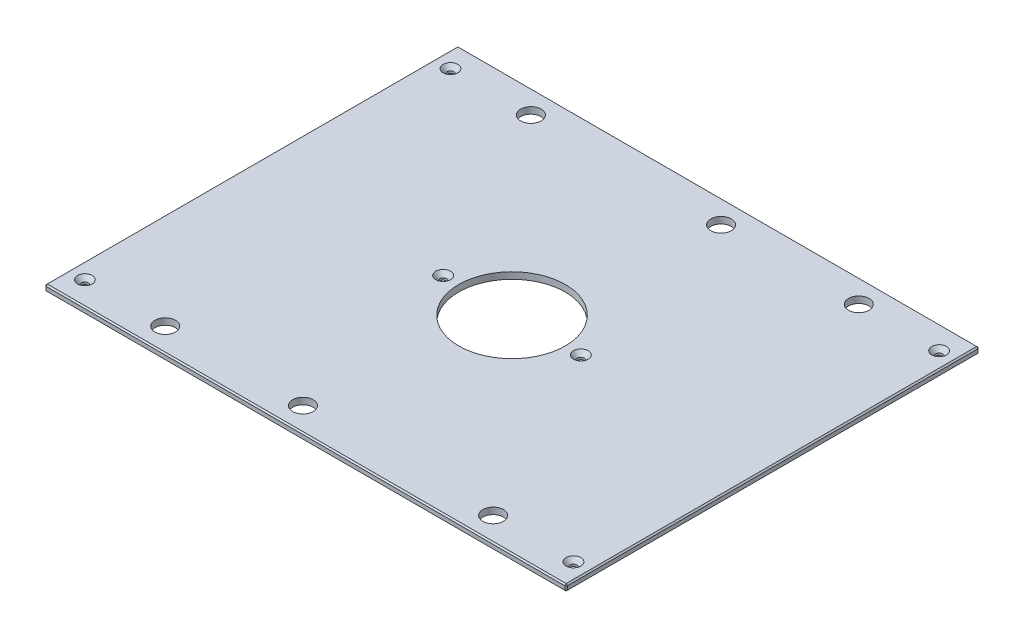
ISO-10303-21;
HEADER;
FILE_DESCRIPTION(('STEP AP214'),'2;1');
FILE_NAME('part.step','',(''),(''),'','','');
FILE_SCHEMA(('AUTOMOTIVE_DESIGN { 1 0 10303 214 1 1 1 1 }'));
ENDSEC;
DATA;
#1=APPLICATION_CONTEXT('core data for automotive mechanical design processes');
#2=APPLICATION_PROTOCOL_DEFINITION('international standard','automotive_design',2000,#1);
#3=PRODUCT_CONTEXT('',#1,'mechanical');
#4=PRODUCT('Part','Part','',(#3));
#5=PRODUCT_RELATED_PRODUCT_CATEGORY('part','',(#4));
#6=PRODUCT_DEFINITION_FORMATION('','',#4);
#7=PRODUCT_DEFINITION_CONTEXT('part definition',#1,'design');
#8=PRODUCT_DEFINITION('design','',#6,#7);
#9=PRODUCT_DEFINITION_SHAPE('','',#8);
#10=(LENGTH_UNIT() NAMED_UNIT(*) SI_UNIT(.MILLI.,.METRE.));
#11=(NAMED_UNIT(*) PLANE_ANGLE_UNIT() SI_UNIT($,.RADIAN.));
#12=(NAMED_UNIT(*) SI_UNIT($,.STERADIAN.) SOLID_ANGLE_UNIT());
#13=UNCERTAINTY_MEASURE_WITH_UNIT(LENGTH_MEASURE(1.E-05),#10,'distance_accuracy_value','');
#14=(GEOMETRIC_REPRESENTATION_CONTEXT(3) GLOBAL_UNCERTAINTY_ASSIGNED_CONTEXT((#13)) GLOBAL_UNIT_ASSIGNED_CONTEXT((#10,
#11,#12)) REPRESENTATION_CONTEXT('',''));
#15=CARTESIAN_POINT('',(0.,0.,0.));
#16=DIRECTION('',(0.,0.,1.));
#17=DIRECTION('',(1.,0.,0.));
#18=AXIS2_PLACEMENT_3D('',#15,#16,#17);
#19=CARTESIAN_POINT('',(-252.4125,6.35,-200.025));
#20=DIRECTION('',(1.,0.,0.));
#21=DIRECTION('',(0.,0.,-1.));
#22=AXIS2_PLACEMENT_3D('',#19,#20,#21);
#23=PLANE('',#22);
#24=DIRECTION('',(0.,0.,-1.));
#25=VECTOR('',#24,1.);
#26=CARTESIAN_POINT('',(-252.4125,5.08000000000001,-200.025));
#27=LINE('',#26,#25);
#28=CARTESIAN_POINT('',(-252.4125,5.08000000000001,198.755));
#29=VERTEX_POINT('',#28);
#30=CARTESIAN_POINT('',(-252.4125,5.08000000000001,-198.755));
#31=VERTEX_POINT('',#30);
#32=EDGE_CURVE('E135',#29,#31,#27,.T.);
#33=ORIENTED_EDGE('',*,*,#32,.T.);
#34=DIRECTION('',(0.,-1.,0.));
#35=VECTOR('',#34,1.);
#36=CARTESIAN_POINT('',(-252.4125,6.35,-198.755));
#37=LINE('',#36,#35);
#38=CARTESIAN_POINT('',(-252.4125,1.26999999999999,-198.755));
#39=VERTEX_POINT('',#38);
#40=EDGE_CURVE('E131',#31,#39,#37,.T.);
#41=ORIENTED_EDGE('',*,*,#40,.T.);
#42=DIRECTION('',(0.,0.,1.));
#43=VECTOR('',#42,1.);
#44=CARTESIAN_POINT('',(-252.4125,1.26999999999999,-200.025));
#45=LINE('',#44,#43);
#46=CARTESIAN_POINT('',(-252.4125,1.26999999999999,198.755));
#47=VERTEX_POINT('',#46);
#48=EDGE_CURVE('E126',#39,#47,#45,.T.);
#49=ORIENTED_EDGE('',*,*,#48,.T.);
#50=DIRECTION('',(0.,1.,0.));
#51=VECTOR('',#50,1.);
#52=CARTESIAN_POINT('',(-252.4125,6.35,198.755));
#53=LINE('',#52,#51);
#54=EDGE_CURVE('E128',#47,#29,#53,.T.);
#55=ORIENTED_EDGE('',*,*,#54,.T.);
#56=EDGE_LOOP('',(#33,#41,#49,#55));
#57=FACE_BOUND('',#56,.T.);
#58=ADVANCED_FACE('F35',(#57),#23,.F.);
#59=CARTESIAN_POINT('',(-252.4125,6.35,200.025));
#60=DIRECTION('',(0.,0.,-1.));
#61=DIRECTION('',(-1.,0.,0.));
#62=AXIS2_PLACEMENT_3D('',#59,#60,#61);
#63=PLANE('',#62);
#64=DIRECTION('',(1.,0.,0.));
#65=VECTOR('',#64,1.);
#66=CARTESIAN_POINT('',(-252.4125,1.26999999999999,200.025));
#67=LINE('',#66,#65);
#68=CARTESIAN_POINT('',(-251.1425,1.26999999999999,200.025));
#69=VERTEX_POINT('',#68);
#70=CARTESIAN_POINT('',(251.1425,1.26999999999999,200.025));
#71=VERTEX_POINT('',#70);
#72=EDGE_CURVE('E58',#69,#71,#67,.T.);
#73=ORIENTED_EDGE('',*,*,#72,.T.);
#74=DIRECTION('',(0.,1.,0.));
#75=VECTOR('',#74,1.);
#76=CARTESIAN_POINT('',(251.1425,6.35,200.025));
#77=LINE('',#76,#75);
#78=CARTESIAN_POINT('',(251.1425,5.08000000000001,200.025));
#79=VERTEX_POINT('',#78);
#80=EDGE_CURVE('E11',#71,#79,#77,.T.);
#81=ORIENTED_EDGE('',*,*,#80,.T.);
#82=DIRECTION('',(-1.,0.,0.));
#83=VECTOR('',#82,1.);
#84=CARTESIAN_POINT('',(-252.4125,5.08000000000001,200.025));
#85=LINE('',#84,#83);
#86=CARTESIAN_POINT('',(-251.1425,5.08000000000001,200.025));
#87=VERTEX_POINT('',#86);
#88=EDGE_CURVE('E44',#79,#87,#85,.T.);
#89=ORIENTED_EDGE('',*,*,#88,.T.);
#90=DIRECTION('',(0.,-1.,0.));
#91=VECTOR('',#90,1.);
#92=CARTESIAN_POINT('',(-251.1425,6.35,200.025));
#93=LINE('',#92,#91);
#94=EDGE_CURVE('E291',#87,#69,#93,.T.);
#95=ORIENTED_EDGE('',*,*,#94,.T.);
#96=EDGE_LOOP('',(#73,#81,#89,#95));
#97=FACE_BOUND('',#96,.T.);
#98=ADVANCED_FACE('F360',(#97),#63,.F.);
#99=CARTESIAN_POINT('',(252.4125,6.35,-200.025));
#100=DIRECTION('',(-1.,0.,0.));
#101=DIRECTION('',(0.,0.,1.));
#102=AXIS2_PLACEMENT_3D('',#99,#100,#101);
#103=PLANE('',#102);
#104=DIRECTION('',(0.,0.,-1.));
#105=VECTOR('',#104,1.);
#106=CARTESIAN_POINT('',(252.4125,1.26999999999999,-200.025));
#107=LINE('',#106,#105);
#108=CARTESIAN_POINT('',(252.4125,1.26999999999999,198.755));
#109=VERTEX_POINT('',#108);
#110=CARTESIAN_POINT('',(252.4125,1.26999999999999,-198.755));
#111=VERTEX_POINT('',#110);
#112=EDGE_CURVE('E286',#109,#111,#107,.T.);
#113=ORIENTED_EDGE('',*,*,#112,.T.);
#114=DIRECTION('',(0.,1.,0.));
#115=VECTOR('',#114,1.);
#116=CARTESIAN_POINT('',(252.4125,6.35,-198.755));
#117=LINE('',#116,#115);
#118=CARTESIAN_POINT('',(252.4125,5.08000000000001,-198.755));
#119=VERTEX_POINT('',#118);
#120=EDGE_CURVE('E288',#111,#119,#117,.T.);
#121=ORIENTED_EDGE('',*,*,#120,.T.);
#122=DIRECTION('',(0.,0.,1.));
#123=VECTOR('',#122,1.);
#124=CARTESIAN_POINT('',(252.4125,5.08000000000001,200.025));
#125=LINE('',#124,#123);
#126=CARTESIAN_POINT('',(252.4125,5.08000000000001,198.755));
#127=VERTEX_POINT('',#126);
#128=EDGE_CURVE('E284',#119,#127,#125,.T.);
#129=ORIENTED_EDGE('',*,*,#128,.T.);
#130=DIRECTION('',(0.,-1.,0.));
#131=VECTOR('',#130,1.);
#132=CARTESIAN_POINT('',(252.4125,6.35,198.755));
#133=LINE('',#132,#131);
#134=EDGE_CURVE('E282',#127,#109,#133,.T.);
#135=ORIENTED_EDGE('',*,*,#134,.T.);
#136=EDGE_LOOP('',(#113,#121,#129,#135));
#137=FACE_BOUND('',#136,.T.);
#138=ADVANCED_FACE('F347',(#137),#103,.F.);
#139=CARTESIAN_POINT('',(-252.4125,6.35,-200.025));
#140=DIRECTION('',(0.,0.,1.));
#141=DIRECTION('',(1.,0.,0.));
#142=AXIS2_PLACEMENT_3D('',#139,#140,#141);
#143=PLANE('',#142);
#144=DIRECTION('',(-1.,0.,0.));
#145=VECTOR('',#144,1.);
#146=CARTESIAN_POINT('',(-252.4125,1.26999999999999,-200.025));
#147=LINE('',#146,#145);
#148=CARTESIAN_POINT('',(251.1425,1.26999999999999,-200.025));
#149=VERTEX_POINT('',#148);
#150=CARTESIAN_POINT('',(-251.1425,1.26999999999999,-200.025));
#151=VERTEX_POINT('',#150);
#152=EDGE_CURVE('E258',#149,#151,#147,.T.);
#153=ORIENTED_EDGE('',*,*,#152,.T.);
#154=DIRECTION('',(0.,1.,0.));
#155=VECTOR('',#154,1.);
#156=CARTESIAN_POINT('',(-251.1425,6.35,-200.025));
#157=LINE('',#156,#155);
#158=CARTESIAN_POINT('',(-251.1425,5.08000000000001,-200.025));
#159=VERTEX_POINT('',#158);
#160=EDGE_CURVE('E262',#151,#159,#157,.T.);
#161=ORIENTED_EDGE('',*,*,#160,.T.);
#162=DIRECTION('',(1.,0.,0.));
#163=VECTOR('',#162,1.);
#164=CARTESIAN_POINT('',(252.4125,5.08000000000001,-200.025));
#165=LINE('',#164,#163);
#166=CARTESIAN_POINT('',(251.1425,5.08000000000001,-200.025));
#167=VERTEX_POINT('',#166);
#168=EDGE_CURVE('E260',#159,#167,#165,.T.);
#169=ORIENTED_EDGE('',*,*,#168,.T.);
#170=DIRECTION('',(0.,-1.,0.));
#171=VECTOR('',#170,1.);
#172=CARTESIAN_POINT('',(251.1425,6.35,-200.025));
#173=LINE('',#172,#171);
#174=EDGE_CURVE('E256',#167,#149,#173,.T.);
#175=ORIENTED_EDGE('',*,*,#174,.T.);
#176=EDGE_LOOP('',(#153,#161,#169,#175));
#177=FACE_BOUND('',#176,.T.);
#178=ADVANCED_FACE('F321',(#177),#143,.F.);
#179=CARTESIAN_POINT('',(0.,6.35,0.));
#180=DIRECTION('',(0.,1.,0.));
#181=DIRECTION('',(0.,0.,1.));
#182=AXIS2_PLACEMENT_3D('',#179,#180,#181);
#183=PLANE('',#182);
#184=CARTESIAN_POINT('',(236.5375,6.35,-177.00498));
#185=DIRECTION('',(0.,1.,0.));
#186=DIRECTION('',(0.,0.,1.));
#187=AXIS2_PLACEMENT_3D('',#184,#185,#186);
#188=CIRCLE('',#187,7.13739999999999);
#189=CARTESIAN_POINT('',(236.5375,6.35,-169.86758));
#190=VERTEX_POINT('',#189);
#191=EDGE_CURVE('E784',#190,#190,#188,.T.);
#192=ORIENTED_EDGE('',*,*,#191,.F.);
#193=EDGE_LOOP('',(#192));
#194=FACE_BOUND('',#193,.T.);
#195=CARTESIAN_POINT('',(236.5375,6.35,177.00498));
#196=DIRECTION('',(0.,1.,0.));
#197=DIRECTION('',(0.,0.,1.));
#198=AXIS2_PLACEMENT_3D('',#195,#196,#197);
#199=CIRCLE('',#198,7.13739999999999);
#200=CARTESIAN_POINT('',(236.5375,6.35,184.14238));
#201=VERTEX_POINT('',#200);
#202=EDGE_CURVE('E788',#201,#201,#199,.T.);
#203=ORIENTED_EDGE('',*,*,#202,.F.);
#204=EDGE_LOOP('',(#203));
#205=FACE_BOUND('',#204,.T.);
#206=CARTESIAN_POINT('',(-236.5375,6.35,177.00498));
#207=DIRECTION('',(0.,1.,0.));
#208=DIRECTION('',(0.,0.,1.));
#209=AXIS2_PLACEMENT_3D('',#206,#207,#208);
#210=CIRCLE('',#209,7.13739999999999);
#211=CARTESIAN_POINT('',(-236.5375,6.35,184.14238));
#212=VERTEX_POINT('',#211);
#213=EDGE_CURVE('E792',#212,#212,#210,.T.);
#214=ORIENTED_EDGE('',*,*,#213,.F.);
#215=EDGE_LOOP('',(#214));
#216=FACE_BOUND('',#215,.T.);
#217=CARTESIAN_POINT('',(-66.675,6.35,0.));
#218=DIRECTION('',(0.,1.,0.));
#219=DIRECTION('',(0.,0.,1.));
#220=AXIS2_PLACEMENT_3D('',#217,#218,#219);
#221=CIRCLE('',#220,7.1374);
#222=CARTESIAN_POINT('',(-66.675,6.35,7.1374));
#223=VERTEX_POINT('',#222);
#224=EDGE_CURVE('E796',#223,#223,#221,.T.);
#225=ORIENTED_EDGE('',*,*,#224,.F.);
#226=EDGE_LOOP('',(#225));
#227=FACE_BOUND('',#226,.T.);
#228=CARTESIAN_POINT('',(66.675,6.35,0.));
#229=DIRECTION('',(0.,1.,0.));
#230=DIRECTION('',(0.,0.,1.));
#231=AXIS2_PLACEMENT_3D('',#228,#229,#230);
#232=CIRCLE('',#231,7.1374);
#233=CARTESIAN_POINT('',(66.675,6.35,7.1374));
#234=VERTEX_POINT('',#233);
#235=EDGE_CURVE('E800',#234,#234,#232,.T.);
#236=ORIENTED_EDGE('',*,*,#235,.F.);
#237=EDGE_LOOP('',(#236));
#238=FACE_BOUND('',#237,.T.);
#239=CARTESIAN_POINT('',(-236.5375,6.35,-177.00498));
#240=DIRECTION('',(0.,1.,0.));
#241=DIRECTION('',(0.,0.,1.));
#242=AXIS2_PLACEMENT_3D('',#239,#240,#241);
#243=CIRCLE('',#242,7.13739999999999);
#244=CARTESIAN_POINT('',(-236.5375,6.35,-169.86758));
#245=VERTEX_POINT('',#244);
#246=EDGE_CURVE('E803',#245,#245,#243,.T.);
#247=ORIENTED_EDGE('',*,*,#246,.F.);
#248=EDGE_LOOP('',(#247));
#249=FACE_BOUND('',#248,.T.);
#250=DIRECTION('',(0.,0.,-1.));
#251=VECTOR('',#250,1.);
#252=CARTESIAN_POINT('',(251.1425,6.35,-200.025));
#253=LINE('',#252,#251);
#254=CARTESIAN_POINT('',(251.1425,6.35,198.755));
#255=VERTEX_POINT('',#254);
#256=CARTESIAN_POINT('',(251.1425,6.35,-198.755));
#257=VERTEX_POINT('',#256);
#258=EDGE_CURVE('E269',#255,#257,#253,.T.);
#259=ORIENTED_EDGE('',*,*,#258,.T.);
#260=DIRECTION('',(-1.,0.,0.));
#261=VECTOR('',#260,1.);
#262=CARTESIAN_POINT('',(-252.4125,6.35,-198.755));
#263=LINE('',#262,#261);
#264=CARTESIAN_POINT('',(-251.1425,6.35,-198.755));
#265=VERTEX_POINT('',#264);
#266=EDGE_CURVE('E271',#257,#265,#263,.T.);
#267=ORIENTED_EDGE('',*,*,#266,.T.);
#268=DIRECTION('',(0.,0.,1.));
#269=VECTOR('',#268,1.);
#270=CARTESIAN_POINT('',(-251.1425,6.35,200.025));
#271=LINE('',#270,#269);
#272=CARTESIAN_POINT('',(-251.1425,6.35,198.755));
#273=VERTEX_POINT('',#272);
#274=EDGE_CURVE('E267',#265,#273,#271,.T.);
#275=ORIENTED_EDGE('',*,*,#274,.T.);
#276=DIRECTION('',(1.,0.,0.));
#277=VECTOR('',#276,1.);
#278=CARTESIAN_POINT('',(252.4125,6.35,198.755));
#279=LINE('',#278,#277);
#280=EDGE_CURVE('E265',#273,#255,#279,.T.);
#281=ORIENTED_EDGE('',*,*,#280,.T.);
#282=EDGE_LOOP('',(#259,#267,#275,#281));
#283=FACE_BOUND('',#282,.T.);
#284=CARTESIAN_POINT('',(158.75,6.35,-177.00498));
#285=DIRECTION('',(0.,1.,0.));
#286=DIRECTION('',(0.,0.,1.));
#287=AXIS2_PLACEMENT_3D('',#284,#285,#286);
#288=CIRCLE('',#287,9.921875);
#289=CARTESIAN_POINT('',(158.75,6.35,-167.083105));
#290=VERTEX_POINT('',#289);
#291=EDGE_CURVE('E204',#290,#290,#288,.T.);
#292=ORIENTED_EDGE('',*,*,#291,.F.);
#293=EDGE_LOOP('',(#292));
#294=FACE_BOUND('',#293,.T.);
#295=CARTESIAN_POINT('',(-158.75,6.35,-177.00498));
#296=DIRECTION('',(0.,1.,0.));
#297=DIRECTION('',(0.,0.,1.));
#298=AXIS2_PLACEMENT_3D('',#295,#296,#297);
#299=CIRCLE('',#298,9.921875);
#300=CARTESIAN_POINT('',(-158.75,6.35,-167.083105));
#301=VERTEX_POINT('',#300);
#302=EDGE_CURVE('E214',#301,#301,#299,.T.);
#303=ORIENTED_EDGE('',*,*,#302,.F.);
#304=EDGE_LOOP('',(#303));
#305=FACE_BOUND('',#304,.T.);
#306=CARTESIAN_POINT('',(158.75,6.35,177.00498));
#307=DIRECTION('',(0.,1.,0.));
#308=DIRECTION('',(0.,0.,1.));
#309=AXIS2_PLACEMENT_3D('',#306,#307,#308);
#310=CIRCLE('',#309,9.921875);
#311=CARTESIAN_POINT('',(158.75,6.35,186.926855));
#312=VERTEX_POINT('',#311);
#313=EDGE_CURVE('E225',#312,#312,#310,.T.);
#314=ORIENTED_EDGE('',*,*,#313,.F.);
#315=EDGE_LOOP('',(#314));
#316=FACE_BOUND('',#315,.T.);
#317=CARTESIAN_POINT('',(-158.75,6.35,177.00498));
#318=DIRECTION('',(0.,1.,0.));
#319=DIRECTION('',(0.,0.,1.));
#320=AXIS2_PLACEMENT_3D('',#317,#318,#319);
#321=CIRCLE('',#320,9.921875);
#322=CARTESIAN_POINT('',(-158.75,6.35,186.926855));
#323=VERTEX_POINT('',#322);
#324=EDGE_CURVE('E231',#323,#323,#321,.T.);
#325=ORIENTED_EDGE('',*,*,#324,.F.);
#326=EDGE_LOOP('',(#325));
#327=FACE_BOUND('',#326,.T.);
#328=CARTESIAN_POINT('',(25.4,6.35,-177.00498));
#329=DIRECTION('',(0.,1.,0.));
#330=DIRECTION('',(0.,0.,1.));
#331=AXIS2_PLACEMENT_3D('',#328,#329,#330);
#332=CIRCLE('',#331,9.921875);
#333=CARTESIAN_POINT('',(25.4,6.35,-167.083105));
#334=VERTEX_POINT('',#333);
#335=EDGE_CURVE('E237',#334,#334,#332,.T.);
#336=ORIENTED_EDGE('',*,*,#335,.F.);
#337=EDGE_LOOP('',(#336));
#338=FACE_BOUND('',#337,.T.);
#339=CARTESIAN_POINT('',(-25.4,6.35,177.00498));
#340=DIRECTION('',(0.,1.,0.));
#341=DIRECTION('',(0.,0.,1.));
#342=AXIS2_PLACEMENT_3D('',#339,#340,#341);
#343=CIRCLE('',#342,9.921875);
#344=CARTESIAN_POINT('',(-25.4,6.35,186.926855));
#345=VERTEX_POINT('',#344);
#346=EDGE_CURVE('E243',#345,#345,#343,.T.);
#347=ORIENTED_EDGE('',*,*,#346,.F.);
#348=EDGE_LOOP('',(#347));
#349=FACE_BOUND('',#348,.T.);
#350=CARTESIAN_POINT('',(0.,6.35,0.));
#351=DIRECTION('',(0.,1.,0.));
#352=DIRECTION('',(0.,0.,1.));
#353=AXIS2_PLACEMENT_3D('',#350,#351,#352);
#354=CIRCLE('',#353,51.562);
#355=CARTESIAN_POINT('',(0.,6.35,51.562));
#356=VERTEX_POINT('',#355);
#357=EDGE_CURVE('E249',#356,#356,#354,.T.);
#358=ORIENTED_EDGE('',*,*,#357,.F.);
#359=EDGE_LOOP('',(#358));
#360=FACE_BOUND('',#359,.T.);
#361=ADVANCED_FACE('F369',(#194,#205,#216,#227,#238,#249,#283,#294,#305,#316,#327,#338,#349,
#360),#183,.T.);
#362=CARTESIAN_POINT('',(0.,0.,0.));
#363=DIRECTION('',(0.,1.,0.));
#364=DIRECTION('',(0.,0.,1.));
#365=AXIS2_PLACEMENT_3D('',#362,#363,#364);
#366=PLANE('',#365);
#367=CARTESIAN_POINT('',(236.5375,0.,-177.00498));
#368=DIRECTION('',(0.,1.,0.));
#369=DIRECTION('',(0.,0.,1.));
#370=AXIS2_PLACEMENT_3D('',#367,#368,#369);
#371=CIRCLE('',#370,3.3782);
#372=CARTESIAN_POINT('',(236.5375,0.,-173.62678));
#373=VERTEX_POINT('',#372);
#374=EDGE_CURVE('E837',#373,#373,#371,.T.);
#375=ORIENTED_EDGE('',*,*,#374,.T.);
#376=EDGE_LOOP('',(#375));
#377=FACE_BOUND('',#376,.T.);
#378=CARTESIAN_POINT('',(236.5375,0.,177.00498));
#379=DIRECTION('',(0.,1.,0.));
#380=DIRECTION('',(0.,0.,1.));
#381=AXIS2_PLACEMENT_3D('',#378,#379,#380);
#382=CIRCLE('',#381,3.3782);
#383=CARTESIAN_POINT('',(236.5375,0.,180.38318));
#384=VERTEX_POINT('',#383);
#385=EDGE_CURVE('E830',#384,#384,#382,.T.);
#386=ORIENTED_EDGE('',*,*,#385,.T.);
#387=EDGE_LOOP('',(#386));
#388=FACE_BOUND('',#387,.T.);
#389=CARTESIAN_POINT('',(-236.5375,0.,177.00498));
#390=DIRECTION('',(0.,1.,0.));
#391=DIRECTION('',(0.,0.,1.));
#392=AXIS2_PLACEMENT_3D('',#389,#390,#391);
#393=CIRCLE('',#392,3.3782);
#394=CARTESIAN_POINT('',(-236.5375,0.,180.38318));
#395=VERTEX_POINT('',#394);
#396=EDGE_CURVE('E823',#395,#395,#393,.T.);
#397=ORIENTED_EDGE('',*,*,#396,.T.);
#398=EDGE_LOOP('',(#397));
#399=FACE_BOUND('',#398,.T.);
#400=CARTESIAN_POINT('',(-66.675,0.,0.));
#401=DIRECTION('',(0.,1.,0.));
#402=DIRECTION('',(0.,0.,1.));
#403=AXIS2_PLACEMENT_3D('',#400,#401,#402);
#404=CIRCLE('',#403,3.3782);
#405=CARTESIAN_POINT('',(-66.675,0.,3.3782));
#406=VERTEX_POINT('',#405);
#407=EDGE_CURVE('E816',#406,#406,#404,.T.);
#408=ORIENTED_EDGE('',*,*,#407,.T.);
#409=EDGE_LOOP('',(#408));
#410=FACE_BOUND('',#409,.T.);
#411=CARTESIAN_POINT('',(66.675,0.,0.));
#412=DIRECTION('',(0.,1.,0.));
#413=DIRECTION('',(0.,0.,1.));
#414=AXIS2_PLACEMENT_3D('',#411,#412,#413);
#415=CIRCLE('',#414,3.3782);
#416=CARTESIAN_POINT('',(66.675,0.,3.3782));
#417=VERTEX_POINT('',#416);
#418=EDGE_CURVE('E806',#417,#417,#415,.T.);
#419=ORIENTED_EDGE('',*,*,#418,.T.);
#420=EDGE_LOOP('',(#419));
#421=FACE_BOUND('',#420,.T.);
#422=CARTESIAN_POINT('',(-236.5375,0.,-177.00498));
#423=DIRECTION('',(0.,1.,0.));
#424=DIRECTION('',(0.,0.,1.));
#425=AXIS2_PLACEMENT_3D('',#422,#423,#424);
#426=CIRCLE('',#425,3.3782);
#427=CARTESIAN_POINT('',(-236.5375,0.,-173.62678));
#428=VERTEX_POINT('',#427);
#429=EDGE_CURVE('E217',#428,#428,#426,.T.);
#430=ORIENTED_EDGE('',*,*,#429,.T.);
#431=EDGE_LOOP('',(#430));
#432=FACE_BOUND('',#431,.T.);
#433=DIRECTION('',(0.,0.,-1.));
#434=VECTOR('',#433,1.);
#435=CARTESIAN_POINT('',(-251.1425,0.,0.));
#436=LINE('',#435,#434);
#437=CARTESIAN_POINT('',(-251.1425,0.,198.755));
#438=VERTEX_POINT('',#437);
#439=CARTESIAN_POINT('',(-251.1425,0.,-198.755));
#440=VERTEX_POINT('',#439);
#441=EDGE_CURVE('E158',#438,#440,#436,.T.);
#442=ORIENTED_EDGE('',*,*,#441,.T.);
#443=DIRECTION('',(1.,0.,0.));
#444=VECTOR('',#443,1.);
#445=CARTESIAN_POINT('',(0.,0.,-198.755));
#446=LINE('',#445,#444);
#447=CARTESIAN_POINT('',(251.1425,0.,-198.755));
#448=VERTEX_POINT('',#447);
#449=EDGE_CURVE('E279',#440,#448,#446,.T.);
#450=ORIENTED_EDGE('',*,*,#449,.T.);
#451=DIRECTION('',(0.,0.,1.));
#452=VECTOR('',#451,1.);
#453=CARTESIAN_POINT('',(251.1425,0.,0.));
#454=LINE('',#453,#452);
#455=CARTESIAN_POINT('',(251.1425,0.,198.755));
#456=VERTEX_POINT('',#455);
#457=EDGE_CURVE('E277',#448,#456,#454,.T.);
#458=ORIENTED_EDGE('',*,*,#457,.T.);
#459=DIRECTION('',(-1.,0.,0.));
#460=VECTOR('',#459,1.);
#461=CARTESIAN_POINT('',(0.,0.,198.755));
#462=LINE('',#461,#460);
#463=EDGE_CURVE('E274',#456,#438,#462,.T.);
#464=ORIENTED_EDGE('',*,*,#463,.T.);
#465=EDGE_LOOP('',(#442,#450,#458,#464));
#466=FACE_BOUND('',#465,.T.);
#467=CARTESIAN_POINT('',(158.75,0.,-177.00498));
#468=DIRECTION('',(0.,1.,0.));
#469=DIRECTION('',(0.,0.,1.));
#470=AXIS2_PLACEMENT_3D('',#467,#468,#469);
#471=CIRCLE('',#470,9.921875);
#472=CARTESIAN_POINT('',(158.75,0.,-167.083105));
#473=VERTEX_POINT('',#472);
#474=EDGE_CURVE('E209',#473,#473,#471,.T.);
#475=ORIENTED_EDGE('',*,*,#474,.T.);
#476=EDGE_LOOP('',(#475));
#477=FACE_BOUND('',#476,.T.);
#478=CARTESIAN_POINT('',(-158.75,0.,-177.00498));
#479=DIRECTION('',(0.,1.,0.));
#480=DIRECTION('',(0.,0.,1.));
#481=AXIS2_PLACEMENT_3D('',#478,#479,#480);
#482=CIRCLE('',#481,9.921875);
#483=CARTESIAN_POINT('',(-158.75,0.,-167.083105));
#484=VERTEX_POINT('',#483);
#485=EDGE_CURVE('E222',#484,#484,#482,.T.);
#486=ORIENTED_EDGE('',*,*,#485,.T.);
#487=EDGE_LOOP('',(#486));
#488=FACE_BOUND('',#487,.T.);
#489=CARTESIAN_POINT('',(158.75,0.,177.00498));
#490=DIRECTION('',(0.,1.,0.));
#491=DIRECTION('',(0.,0.,1.));
#492=AXIS2_PLACEMENT_3D('',#489,#490,#491);
#493=CIRCLE('',#492,9.921875);
#494=CARTESIAN_POINT('',(158.75,0.,186.926855));
#495=VERTEX_POINT('',#494);
#496=EDGE_CURVE('E228',#495,#495,#493,.T.);
#497=ORIENTED_EDGE('',*,*,#496,.T.);
#498=EDGE_LOOP('',(#497));
#499=FACE_BOUND('',#498,.T.);
#500=CARTESIAN_POINT('',(-158.75,0.,177.00498));
#501=DIRECTION('',(0.,1.,0.));
#502=DIRECTION('',(0.,0.,1.));
#503=AXIS2_PLACEMENT_3D('',#500,#501,#502);
#504=CIRCLE('',#503,9.921875);
#505=CARTESIAN_POINT('',(-158.75,0.,186.926855));
#506=VERTEX_POINT('',#505);
#507=EDGE_CURVE('E234',#506,#506,#504,.T.);
#508=ORIENTED_EDGE('',*,*,#507,.T.);
#509=EDGE_LOOP('',(#508));
#510=FACE_BOUND('',#509,.T.);
#511=CARTESIAN_POINT('',(25.4,0.,-177.00498));
#512=DIRECTION('',(0.,1.,0.));
#513=DIRECTION('',(0.,0.,1.));
#514=AXIS2_PLACEMENT_3D('',#511,#512,#513);
#515=CIRCLE('',#514,9.921875);
#516=CARTESIAN_POINT('',(25.4,0.,-167.083105));
#517=VERTEX_POINT('',#516);
#518=EDGE_CURVE('E240',#517,#517,#515,.T.);
#519=ORIENTED_EDGE('',*,*,#518,.T.);
#520=EDGE_LOOP('',(#519));
#521=FACE_BOUND('',#520,.T.);
#522=CARTESIAN_POINT('',(-25.4,0.,177.00498));
#523=DIRECTION('',(0.,1.,0.));
#524=DIRECTION('',(0.,0.,1.));
#525=AXIS2_PLACEMENT_3D('',#522,#523,#524);
#526=CIRCLE('',#525,9.921875);
#527=CARTESIAN_POINT('',(-25.4,0.,186.926855));
#528=VERTEX_POINT('',#527);
#529=EDGE_CURVE('E246',#528,#528,#526,.T.);
#530=ORIENTED_EDGE('',*,*,#529,.T.);
#531=EDGE_LOOP('',(#530));
#532=FACE_BOUND('',#531,.T.);
#533=CARTESIAN_POINT('',(0.,0.,0.));
#534=DIRECTION('',(0.,1.,0.));
#535=DIRECTION('',(0.,0.,1.));
#536=AXIS2_PLACEMENT_3D('',#533,#534,#535);
#537=CIRCLE('',#536,51.562);
#538=CARTESIAN_POINT('',(0.,0.,51.562));
#539=VERTEX_POINT('',#538);
#540=EDGE_CURVE('E147',#539,#539,#537,.T.);
#541=ORIENTED_EDGE('',*,*,#540,.T.);
#542=EDGE_LOOP('',(#541));
#543=FACE_BOUND('',#542,.T.);
#544=ADVANCED_FACE('F334',(#377,#388,#399,#410,#421,#432,#466,#477,#488,#499,#510,#521,#532,
#543),#366,.F.);
#545=CARTESIAN_POINT('',(0.,0.,0.));
#546=DIRECTION('',(0.,1.,0.));
#547=DIRECTION('',(0.,0.,1.));
#548=AXIS2_PLACEMENT_3D('',#545,#546,#547);
#549=CYLINDRICAL_SURFACE('',#548,51.562);
#550=ORIENTED_EDGE('',*,*,#540,.F.);
#551=EDGE_LOOP('',(#550));
#552=FACE_BOUND('',#551,.T.);
#553=ORIENTED_EDGE('',*,*,#357,.T.);
#554=EDGE_LOOP('',(#553));
#555=FACE_BOUND('',#554,.T.);
#556=ADVANCED_FACE('F721',(#552,#555),#549,.F.);
#557=CARTESIAN_POINT('',(-25.4,6.35,177.00498));
#558=DIRECTION('',(0.,1.,0.));
#559=DIRECTION('',(0.,0.,1.));
#560=AXIS2_PLACEMENT_3D('',#557,#558,#559);
#561=CYLINDRICAL_SURFACE('',#560,9.921875);
#562=ORIENTED_EDGE('',*,*,#529,.F.);
#563=EDGE_LOOP('',(#562));
#564=FACE_BOUND('',#563,.T.);
#565=ORIENTED_EDGE('',*,*,#346,.T.);
#566=EDGE_LOOP('',(#565));
#567=FACE_BOUND('',#566,.T.);
#568=ADVANCED_FACE('F712',(#564,#567),#561,.F.);
#569=CARTESIAN_POINT('',(25.4,6.35,-177.00498));
#570=DIRECTION('',(0.,1.,0.));
#571=DIRECTION('',(0.,0.,1.));
#572=AXIS2_PLACEMENT_3D('',#569,#570,#571);
#573=CYLINDRICAL_SURFACE('',#572,9.921875);
#574=ORIENTED_EDGE('',*,*,#518,.F.);
#575=EDGE_LOOP('',(#574));
#576=FACE_BOUND('',#575,.T.);
#577=ORIENTED_EDGE('',*,*,#335,.T.);
#578=EDGE_LOOP('',(#577));
#579=FACE_BOUND('',#578,.T.);
#580=ADVANCED_FACE('F703',(#576,#579),#573,.F.);
#581=CARTESIAN_POINT('',(-158.75,6.35,177.00498));
#582=DIRECTION('',(0.,1.,0.));
#583=DIRECTION('',(0.,0.,1.));
#584=AXIS2_PLACEMENT_3D('',#581,#582,#583);
#585=CYLINDRICAL_SURFACE('',#584,9.921875);
#586=ORIENTED_EDGE('',*,*,#507,.F.);
#587=EDGE_LOOP('',(#586));
#588=FACE_BOUND('',#587,.T.);
#589=ORIENTED_EDGE('',*,*,#324,.T.);
#590=EDGE_LOOP('',(#589));
#591=FACE_BOUND('',#590,.T.);
#592=ADVANCED_FACE('F694',(#588,#591),#585,.F.);
#593=CARTESIAN_POINT('',(158.75,6.35,177.00498));
#594=DIRECTION('',(0.,1.,0.));
#595=DIRECTION('',(0.,0.,1.));
#596=AXIS2_PLACEMENT_3D('',#593,#594,#595);
#597=CYLINDRICAL_SURFACE('',#596,9.921875);
#598=ORIENTED_EDGE('',*,*,#496,.F.);
#599=EDGE_LOOP('',(#598));
#600=FACE_BOUND('',#599,.T.);
#601=ORIENTED_EDGE('',*,*,#313,.T.);
#602=EDGE_LOOP('',(#601));
#603=FACE_BOUND('',#602,.T.);
#604=ADVANCED_FACE('F685',(#600,#603),#597,.F.);
#605=CARTESIAN_POINT('',(-158.75,6.35,-177.00498));
#606=DIRECTION('',(0.,1.,0.));
#607=DIRECTION('',(0.,0.,1.));
#608=AXIS2_PLACEMENT_3D('',#605,#606,#607);
#609=CYLINDRICAL_SURFACE('',#608,9.921875);
#610=ORIENTED_EDGE('',*,*,#485,.F.);
#611=EDGE_LOOP('',(#610));
#612=FACE_BOUND('',#611,.T.);
#613=ORIENTED_EDGE('',*,*,#302,.T.);
#614=EDGE_LOOP('',(#613));
#615=FACE_BOUND('',#614,.T.);
#616=ADVANCED_FACE('F675',(#612,#615),#609,.F.);
#617=CARTESIAN_POINT('',(158.75,6.35,-177.00498));
#618=DIRECTION('',(0.,1.,0.));
#619=DIRECTION('',(0.,0.,1.));
#620=AXIS2_PLACEMENT_3D('',#617,#618,#619);
#621=CYLINDRICAL_SURFACE('',#620,9.921875);
#622=ORIENTED_EDGE('',*,*,#474,.F.);
#623=EDGE_LOOP('',(#622));
#624=FACE_BOUND('',#623,.T.);
#625=ORIENTED_EDGE('',*,*,#291,.T.);
#626=EDGE_LOOP('',(#625));
#627=FACE_BOUND('',#626,.T.);
#628=ADVANCED_FACE('F378',(#624,#627),#621,.F.);
#629=CARTESIAN_POINT('',(252.4125,6.35,198.755));
#630=DIRECTION('',(-0.707106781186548,0.,-0.707106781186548));
#631=DIRECTION('',(0.,-1.,0.));
#632=AXIS2_PLACEMENT_3D('',#629,#630,#631);
#633=PLANE('',#632);
#634=DIRECTION('',(-0.707106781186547,0.,0.707106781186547));
#635=VECTOR('',#634,1.);
#636=CARTESIAN_POINT('',(252.4125,5.08000000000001,198.755));
#637=LINE('',#636,#635);
#638=EDGE_CURVE('E39',#79,#127,#637,.F.);
#639=ORIENTED_EDGE('',*,*,#638,.F.);
#640=ORIENTED_EDGE('',*,*,#80,.F.);
#641=DIRECTION('',(0.707106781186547,0.,-0.707106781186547));
#642=VECTOR('',#641,1.);
#643=CARTESIAN_POINT('',(251.7775,1.26999999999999,199.39));
#644=LINE('',#643,#642);
#645=EDGE_CURVE('E197',#109,#71,#644,.F.);
#646=ORIENTED_EDGE('',*,*,#645,.F.);
#647=ORIENTED_EDGE('',*,*,#134,.F.);
#648=EDGE_LOOP('',(#639,#640,#646,#647));
#649=FACE_BOUND('',#648,.T.);
#650=ADVANCED_FACE('F37',(#649),#633,.F.);
#651=CARTESIAN_POINT('',(252.4125,5.08000000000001,198.755));
#652=DIRECTION('',(0.577350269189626,0.577350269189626,0.577350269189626));
#653=DIRECTION('',(0.707106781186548,0.,-0.707106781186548));
#654=AXIS2_PLACEMENT_3D('',#651,#652,#653);
#655=PLANE('',#654);
#656=DIRECTION('',(0.,-0.707106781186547,0.707106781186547));
#657=VECTOR('',#656,1.);
#658=CARTESIAN_POINT('',(251.1425,5.715,199.39));
#659=LINE('',#658,#657);
#660=EDGE_CURVE('E193',#79,#255,#659,.F.);
#661=ORIENTED_EDGE('',*,*,#660,.F.);
#662=ORIENTED_EDGE('',*,*,#638,.T.);
#663=DIRECTION('',(-0.707106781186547,0.707106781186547,0.));
#664=VECTOR('',#663,1.);
#665=CARTESIAN_POINT('',(252.4125,5.08000000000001,198.755));
#666=LINE('',#665,#664);
#667=EDGE_CURVE('E195',#255,#127,#666,.F.);
#668=ORIENTED_EDGE('',*,*,#667,.F.);
#669=EDGE_LOOP('',(#661,#662,#668));
#670=FACE_BOUND('',#669,.T.);
#671=ADVANCED_FACE('F371',(#670),#655,.T.);
#672=CARTESIAN_POINT('',(251.1425,0.,198.755));
#673=DIRECTION('',(0.577350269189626,-0.577350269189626,0.577350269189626));
#674=DIRECTION('',(0.707106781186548,0.,-0.707106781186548));
#675=AXIS2_PLACEMENT_3D('',#672,#673,#674);
#676=PLANE('',#675);
#677=DIRECTION('',(-0.707106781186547,-0.707106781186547,0.));
#678=VECTOR('',#677,1.);
#679=CARTESIAN_POINT('',(251.1425,0.,198.755));
#680=LINE('',#679,#678);
#681=EDGE_CURVE('E187',#109,#456,#680,.T.);
#682=ORIENTED_EDGE('',*,*,#681,.F.);
#683=ORIENTED_EDGE('',*,*,#645,.T.);
#684=DIRECTION('',(0.,0.707106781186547,0.707106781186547));
#685=VECTOR('',#684,1.);
#686=CARTESIAN_POINT('',(251.1425,0.,198.755));
#687=LINE('',#686,#685);
#688=EDGE_CURVE('E190',#456,#71,#687,.T.);
#689=ORIENTED_EDGE('',*,*,#688,.F.);
#690=EDGE_LOOP('',(#682,#683,#689));
#691=FACE_BOUND('',#690,.T.);
#692=ADVANCED_FACE('F340',(#691),#676,.T.);
#693=CARTESIAN_POINT('',(251.1425,6.35,0.));
#694=DIRECTION('',(0.707106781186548,0.707106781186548,0.));
#695=DIRECTION('',(0.,0.,1.));
#696=AXIS2_PLACEMENT_3D('',#693,#694,#695);
#697=PLANE('',#696);
#698=ORIENTED_EDGE('',*,*,#667,.T.);
#699=ORIENTED_EDGE('',*,*,#128,.F.);
#700=DIRECTION('',(0.707106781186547,-0.707106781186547,0.));
#701=VECTOR('',#700,1.);
#702=CARTESIAN_POINT('',(251.7775,5.715,-198.755));
#703=LINE('',#702,#701);
#704=EDGE_CURVE('E182',#257,#119,#703,.T.);
#705=ORIENTED_EDGE('',*,*,#704,.F.);
#706=ORIENTED_EDGE('',*,*,#258,.F.);
#707=EDGE_LOOP('',(#698,#699,#705,#706));
#708=FACE_BOUND('',#707,.T.);
#709=ADVANCED_FACE('F357',(#708),#697,.T.);
#710=CARTESIAN_POINT('',(0.,6.35,198.755));
#711=DIRECTION('',(0.,0.707106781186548,0.707106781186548));
#712=DIRECTION('',(-1.,0.,0.));
#713=AXIS2_PLACEMENT_3D('',#710,#711,#712);
#714=PLANE('',#713);
#715=ORIENTED_EDGE('',*,*,#660,.T.);
#716=ORIENTED_EDGE('',*,*,#280,.F.);
#717=DIRECTION('',(0.,0.707106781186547,-0.707106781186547));
#718=VECTOR('',#717,1.);
#719=CARTESIAN_POINT('',(-251.1425,6.35,198.755));
#720=LINE('',#719,#718);
#721=EDGE_CURVE('E179',#87,#273,#720,.T.);
#722=ORIENTED_EDGE('',*,*,#721,.F.);
#723=ORIENTED_EDGE('',*,*,#88,.F.);
#724=EDGE_LOOP('',(#715,#716,#722,#723));
#725=FACE_BOUND('',#724,.T.);
#726=ADVANCED_FACE('F362',(#725),#714,.T.);
#727=CARTESIAN_POINT('',(-251.1425,6.35,200.025));
#728=DIRECTION('',(0.707106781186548,0.,-0.707106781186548));
#729=DIRECTION('',(0.,-1.,0.));
#730=AXIS2_PLACEMENT_3D('',#727,#728,#729);
#731=PLANE('',#730);
#732=DIRECTION('',(0.707106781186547,0.,0.707106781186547));
#733=VECTOR('',#732,1.);
#734=CARTESIAN_POINT('',(-252.4125,1.26999999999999,198.755));
#735=LINE('',#734,#733);
#736=EDGE_CURVE('E142',#69,#47,#735,.F.);
#737=ORIENTED_EDGE('',*,*,#736,.F.);
#738=ORIENTED_EDGE('',*,*,#94,.F.);
#739=DIRECTION('',(-0.707106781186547,0.,-0.707106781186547));
#740=VECTOR('',#739,1.);
#741=CARTESIAN_POINT('',(-251.7775,5.08000000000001,199.39));
#742=LINE('',#741,#740);
#743=EDGE_CURVE('E145',#29,#87,#742,.F.);
#744=ORIENTED_EDGE('',*,*,#743,.F.);
#745=ORIENTED_EDGE('',*,*,#54,.F.);
#746=EDGE_LOOP('',(#737,#738,#744,#745));
#747=FACE_BOUND('',#746,.T.);
#748=ADVANCED_FACE('F140',(#747),#731,.F.);
#749=CARTESIAN_POINT('',(-252.4125,1.26999999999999,200.025));
#750=DIRECTION('',(0.,0.707106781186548,-0.707106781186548));
#751=DIRECTION('',(1.,0.,0.));
#752=AXIS2_PLACEMENT_3D('',#749,#750,#751);
#753=PLANE('',#752);
#754=ORIENTED_EDGE('',*,*,#688,.T.);
#755=ORIENTED_EDGE('',*,*,#72,.F.);
#756=DIRECTION('',(0.,-0.707106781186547,-0.707106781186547));
#757=VECTOR('',#756,1.);
#758=CARTESIAN_POINT('',(-251.1425,0.634999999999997,199.39));
#759=LINE('',#758,#757);
#760=EDGE_CURVE('E155',#438,#69,#759,.F.);
#761=ORIENTED_EDGE('',*,*,#760,.F.);
#762=ORIENTED_EDGE('',*,*,#463,.F.);
#763=EDGE_LOOP('',(#754,#755,#761,#762));
#764=FACE_BOUND('',#763,.T.);
#765=ADVANCED_FACE('F339',(#764),#753,.F.);
#766=CARTESIAN_POINT('',(252.4125,1.26999999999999,-200.025));
#767=DIRECTION('',(-0.707106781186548,0.707106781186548,0.));
#768=DIRECTION('',(0.,0.,-1.));
#769=AXIS2_PLACEMENT_3D('',#766,#767,#768);
#770=PLANE('',#769);
#771=ORIENTED_EDGE('',*,*,#681,.T.);
#772=ORIENTED_EDGE('',*,*,#457,.F.);
#773=DIRECTION('',(0.707106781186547,0.707106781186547,0.));
#774=VECTOR('',#773,1.);
#775=CARTESIAN_POINT('',(251.1425,0.,-198.755));
#776=LINE('',#775,#774);
#777=EDGE_CURVE('E174',#111,#448,#776,.F.);
#778=ORIENTED_EDGE('',*,*,#777,.F.);
#779=ORIENTED_EDGE('',*,*,#112,.F.);
#780=EDGE_LOOP('',(#771,#772,#778,#779));
#781=FACE_BOUND('',#780,.T.);
#782=ADVANCED_FACE('F344',(#781),#770,.F.);
#783=CARTESIAN_POINT('',(251.1425,6.35,-200.025));
#784=DIRECTION('',(-0.707106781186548,0.,0.707106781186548));
#785=DIRECTION('',(0.,-1.,0.));
#786=AXIS2_PLACEMENT_3D('',#783,#784,#785);
#787=PLANE('',#786);
#788=DIRECTION('',(0.707106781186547,0.,0.707106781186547));
#789=VECTOR('',#788,1.);
#790=CARTESIAN_POINT('',(251.1425,5.08000000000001,-200.025));
#791=LINE('',#790,#789);
#792=EDGE_CURVE('E184',#119,#167,#791,.F.);
#793=ORIENTED_EDGE('',*,*,#792,.F.);
#794=ORIENTED_EDGE('',*,*,#120,.F.);
#795=DIRECTION('',(-0.707106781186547,0.,-0.707106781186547));
#796=VECTOR('',#795,1.);
#797=CARTESIAN_POINT('',(251.7775,1.26999999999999,-199.39));
#798=LINE('',#797,#796);
#799=EDGE_CURVE('E171',#149,#111,#798,.F.);
#800=ORIENTED_EDGE('',*,*,#799,.F.);
#801=ORIENTED_EDGE('',*,*,#174,.F.);
#802=EDGE_LOOP('',(#793,#794,#800,#801));
#803=FACE_BOUND('',#802,.T.);
#804=ADVANCED_FACE('F352',(#803),#787,.F.);
#805=CARTESIAN_POINT('',(251.1425,5.08000000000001,-200.025));
#806=DIRECTION('',(0.577350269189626,0.577350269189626,-0.577350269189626));
#807=DIRECTION('',(-0.707106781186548,0.,-0.707106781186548));
#808=AXIS2_PLACEMENT_3D('',#805,#806,#807);
#809=PLANE('',#808);
#810=ORIENTED_EDGE('',*,*,#704,.T.);
#811=ORIENTED_EDGE('',*,*,#792,.T.);
#812=DIRECTION('',(0.,0.707106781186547,0.707106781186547));
#813=VECTOR('',#812,1.);
#814=CARTESIAN_POINT('',(251.1425,5.08000000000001,-200.025));
#815=LINE('',#814,#813);
#816=EDGE_CURVE('E163',#257,#167,#815,.F.);
#817=ORIENTED_EDGE('',*,*,#816,.F.);
#818=EDGE_LOOP('',(#810,#811,#817));
#819=FACE_BOUND('',#818,.T.);
#820=ADVANCED_FACE('F410',(#819),#809,.T.);
#821=CARTESIAN_POINT('',(-251.1425,6.35,198.755));
#822=DIRECTION('',(-0.577350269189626,0.577350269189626,0.577350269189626));
#823=DIRECTION('',(0.707106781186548,0.,0.707106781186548));
#824=AXIS2_PLACEMENT_3D('',#821,#822,#823);
#825=PLANE('',#824);
#826=ORIENTED_EDGE('',*,*,#743,.T.);
#827=ORIENTED_EDGE('',*,*,#721,.T.);
#828=DIRECTION('',(-0.707106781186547,-0.707106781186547,0.));
#829=VECTOR('',#828,1.);
#830=CARTESIAN_POINT('',(-251.1425,6.35,198.755));
#831=LINE('',#830,#829);
#832=EDGE_CURVE('E159',#29,#273,#831,.F.);
#833=ORIENTED_EDGE('',*,*,#832,.F.);
#834=EDGE_LOOP('',(#826,#827,#833));
#835=FACE_BOUND('',#834,.T.);
#836=ADVANCED_FACE('F364',(#835),#825,.T.);
#837=CARTESIAN_POINT('',(-252.4125,1.26999999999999,198.755));
#838=DIRECTION('',(-0.577350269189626,-0.577350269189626,0.577350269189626));
#839=DIRECTION('',(0.707106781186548,0.,0.707106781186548));
#840=AXIS2_PLACEMENT_3D('',#837,#838,#839);
#841=PLANE('',#840);
#842=ORIENTED_EDGE('',*,*,#760,.T.);
#843=ORIENTED_EDGE('',*,*,#736,.T.);
#844=DIRECTION('',(-0.707106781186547,0.707106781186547,0.));
#845=VECTOR('',#844,1.);
#846=CARTESIAN_POINT('',(-252.4125,1.26999999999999,198.755));
#847=LINE('',#846,#845);
#848=EDGE_CURVE('E152',#438,#47,#847,.T.);
#849=ORIENTED_EDGE('',*,*,#848,.F.);
#850=EDGE_LOOP('',(#842,#843,#849));
#851=FACE_BOUND('',#850,.T.);
#852=ADVANCED_FACE('F151',(#851),#841,.T.);
#853=CARTESIAN_POINT('',(251.1425,0.,-198.755));
#854=DIRECTION('',(0.577350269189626,-0.577350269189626,-0.577350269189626));
#855=DIRECTION('',(-0.707106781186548,0.,-0.707106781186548));
#856=AXIS2_PLACEMENT_3D('',#853,#854,#855);
#857=PLANE('',#856);
#858=ORIENTED_EDGE('',*,*,#799,.T.);
#859=ORIENTED_EDGE('',*,*,#777,.T.);
#860=DIRECTION('',(0.,-0.707106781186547,0.707106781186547));
#861=VECTOR('',#860,1.);
#862=CARTESIAN_POINT('',(251.1425,0.,-198.755));
#863=LINE('',#862,#861);
#864=EDGE_CURVE('E160',#149,#448,#863,.T.);
#865=ORIENTED_EDGE('',*,*,#864,.F.);
#866=EDGE_LOOP('',(#858,#859,#865));
#867=FACE_BOUND('',#866,.T.);
#868=ADVANCED_FACE('F402',(#867),#857,.T.);
#869=CARTESIAN_POINT('',(0.,6.35,-198.755));
#870=DIRECTION('',(0.,0.707106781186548,-0.707106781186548));
#871=DIRECTION('',(1.,0.,0.));
#872=AXIS2_PLACEMENT_3D('',#869,#870,#871);
#873=PLANE('',#872);
#874=ORIENTED_EDGE('',*,*,#816,.T.);
#875=ORIENTED_EDGE('',*,*,#168,.F.);
#876=DIRECTION('',(0.,-0.707106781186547,-0.707106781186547));
#877=VECTOR('',#876,1.);
#878=CARTESIAN_POINT('',(-251.1425,5.08000000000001,-200.025));
#879=LINE('',#878,#877);
#880=EDGE_CURVE('E165',#265,#159,#879,.T.);
#881=ORIENTED_EDGE('',*,*,#880,.F.);
#882=ORIENTED_EDGE('',*,*,#266,.F.);
#883=EDGE_LOOP('',(#874,#875,#881,#882));
#884=FACE_BOUND('',#883,.T.);
#885=ADVANCED_FACE('F316',(#884),#873,.T.);
#886=CARTESIAN_POINT('',(-251.1425,6.35,0.));
#887=DIRECTION('',(-0.707106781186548,0.707106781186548,0.));
#888=DIRECTION('',(0.,0.,-1.));
#889=AXIS2_PLACEMENT_3D('',#886,#887,#888);
#890=PLANE('',#889);
#891=ORIENTED_EDGE('',*,*,#832,.T.);
#892=ORIENTED_EDGE('',*,*,#274,.F.);
#893=DIRECTION('',(0.707106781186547,0.707106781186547,0.));
#894=VECTOR('',#893,1.);
#895=CARTESIAN_POINT('',(-251.7775,5.715,-198.755));
#896=LINE('',#895,#894);
#897=EDGE_CURVE('E305',#31,#265,#896,.T.);
#898=ORIENTED_EDGE('',*,*,#897,.F.);
#899=ORIENTED_EDGE('',*,*,#32,.F.);
#900=EDGE_LOOP('',(#891,#892,#898,#899));
#901=FACE_BOUND('',#900,.T.);
#902=ADVANCED_FACE('F367',(#901),#890,.T.);
#903=CARTESIAN_POINT('',(-252.4125,1.26999999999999,-200.025));
#904=DIRECTION('',(0.707106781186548,0.707106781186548,0.));
#905=DIRECTION('',(0.,0.,1.));
#906=AXIS2_PLACEMENT_3D('',#903,#904,#905);
#907=PLANE('',#906);
#908=ORIENTED_EDGE('',*,*,#848,.T.);
#909=ORIENTED_EDGE('',*,*,#48,.F.);
#910=DIRECTION('',(0.707106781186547,-0.707106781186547,0.));
#911=VECTOR('',#910,1.);
#912=CARTESIAN_POINT('',(-252.4125,1.26999999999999,-198.755));
#913=LINE('',#912,#911);
#914=EDGE_CURVE('E302',#440,#39,#913,.F.);
#915=ORIENTED_EDGE('',*,*,#914,.F.);
#916=ORIENTED_EDGE('',*,*,#441,.F.);
#917=EDGE_LOOP('',(#908,#909,#915,#916));
#918=FACE_BOUND('',#917,.T.);
#919=ADVANCED_FACE('F157',(#918),#907,.F.);
#920=CARTESIAN_POINT('',(-252.4125,1.26999999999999,-200.025));
#921=DIRECTION('',(0.,0.707106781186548,0.707106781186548));
#922=DIRECTION('',(-1.,0.,0.));
#923=AXIS2_PLACEMENT_3D('',#920,#921,#922);
#924=PLANE('',#923);
#925=ORIENTED_EDGE('',*,*,#864,.T.);
#926=ORIENTED_EDGE('',*,*,#449,.F.);
#927=DIRECTION('',(0.,0.707106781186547,-0.707106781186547));
#928=VECTOR('',#927,1.);
#929=CARTESIAN_POINT('',(-251.1425,0.634999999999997,-199.39));
#930=LINE('',#929,#928);
#931=EDGE_CURVE('E299',#151,#440,#930,.F.);
#932=ORIENTED_EDGE('',*,*,#931,.F.);
#933=ORIENTED_EDGE('',*,*,#152,.F.);
#934=EDGE_LOOP('',(#925,#926,#932,#933));
#935=FACE_BOUND('',#934,.T.);
#936=ADVANCED_FACE('F331',(#935),#924,.F.);
#937=CARTESIAN_POINT('',(-251.1425,5.08000000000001,-200.025));
#938=DIRECTION('',(-0.577350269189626,0.577350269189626,-0.577350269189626));
#939=DIRECTION('',(-0.707106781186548,0.,0.707106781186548));
#940=AXIS2_PLACEMENT_3D('',#937,#938,#939);
#941=PLANE('',#940);
#942=ORIENTED_EDGE('',*,*,#897,.T.);
#943=ORIENTED_EDGE('',*,*,#880,.T.);
#944=DIRECTION('',(0.707106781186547,0.,-0.707106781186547));
#945=VECTOR('',#944,1.);
#946=CARTESIAN_POINT('',(-251.1425,5.08000000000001,-200.025));
#947=LINE('',#946,#945);
#948=EDGE_CURVE('E297',#31,#159,#947,.T.);
#949=ORIENTED_EDGE('',*,*,#948,.F.);
#950=EDGE_LOOP('',(#942,#943,#949));
#951=FACE_BOUND('',#950,.T.);
#952=ADVANCED_FACE('F311',(#951),#941,.T.);
#953=CARTESIAN_POINT('',(-252.4125,1.26999999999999,-198.755));
#954=DIRECTION('',(-0.577350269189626,-0.577350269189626,-0.577350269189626));
#955=DIRECTION('',(-0.707106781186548,0.,0.707106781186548));
#956=AXIS2_PLACEMENT_3D('',#953,#954,#955);
#957=PLANE('',#956);
#958=ORIENTED_EDGE('',*,*,#931,.T.);
#959=ORIENTED_EDGE('',*,*,#914,.T.);
#960=DIRECTION('',(-0.707106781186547,0.,0.707106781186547));
#961=VECTOR('',#960,1.);
#962=CARTESIAN_POINT('',(-252.4125,1.26999999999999,-198.755));
#963=LINE('',#962,#961);
#964=EDGE_CURVE('E295',#151,#39,#963,.T.);
#965=ORIENTED_EDGE('',*,*,#964,.F.);
#966=EDGE_LOOP('',(#958,#959,#965));
#967=FACE_BOUND('',#966,.T.);
#968=ADVANCED_FACE('F328',(#967),#957,.T.);
#969=CARTESIAN_POINT('',(-252.4125,6.35,-198.755));
#970=DIRECTION('',(0.707106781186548,0.,0.707106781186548));
#971=DIRECTION('',(0.,-1.,0.));
#972=AXIS2_PLACEMENT_3D('',#969,#970,#971);
#973=PLANE('',#972);
#974=ORIENTED_EDGE('',*,*,#948,.T.);
#975=ORIENTED_EDGE('',*,*,#160,.F.);
#976=ORIENTED_EDGE('',*,*,#964,.T.);
#977=ORIENTED_EDGE('',*,*,#40,.F.);
#978=EDGE_LOOP('',(#974,#975,#976,#977));
#979=FACE_BOUND('',#978,.T.);
#980=ADVANCED_FACE('F326',(#979),#973,.F.);
#981=CARTESIAN_POINT('',(-236.5375,6.35,-177.00498));
#982=DIRECTION('',(0.,1.,0.));
#983=DIRECTION('',(0.,0.,1.));
#984=AXIS2_PLACEMENT_3D('',#981,#982,#983);
#985=CYLINDRICAL_SURFACE('',#984,3.3782);
#986=ORIENTED_EDGE('',*,*,#429,.F.);
#987=EDGE_LOOP('',(#986));
#988=FACE_BOUND('',#987,.T.);
#989=CARTESIAN_POINT('',(-236.5375,2.02553508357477,-177.00498));
#990=DIRECTION('',(0.,1.,0.));
#991=DIRECTION('',(0.,0.,1.));
#992=AXIS2_PLACEMENT_3D('',#989,#990,#991);
#993=CIRCLE('',#992,3.3782);
#994=CARTESIAN_POINT('',(-236.5375,2.02553508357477,-173.62678));
#995=VERTEX_POINT('',#994);
#996=EDGE_CURVE('E805',#995,#995,#993,.T.);
#997=ORIENTED_EDGE('',*,*,#996,.T.);
#998=EDGE_LOOP('',(#997));
#999=FACE_BOUND('',#998,.T.);
#1000=ADVANCED_FACE('F389',(#988,#999),#985,.F.);
#1001=CARTESIAN_POINT('',(-236.5375,6.35,-177.00498));
#1002=DIRECTION('',(0.,1.,0.));
#1003=DIRECTION('',(0.,0.,1.));
#1004=AXIS2_PLACEMENT_3D('',#1001,#1002,#1003);
#1005=CONICAL_SURFACE('',#1004,7.13739999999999,0.715584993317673);
#1006=ORIENTED_EDGE('',*,*,#996,.F.);
#1007=EDGE_LOOP('',(#1006));
#1008=FACE_BOUND('',#1007,.T.);
#1009=ORIENTED_EDGE('',*,*,#246,.T.);
#1010=EDGE_LOOP('',(#1009));
#1011=FACE_BOUND('',#1010,.T.);
#1012=ADVANCED_FACE('F499',(#1008,#1011),#1005,.F.);
#1013=CARTESIAN_POINT('',(66.675,6.35,0.));
#1014=DIRECTION('',(0.,1.,0.));
#1015=DIRECTION('',(0.,0.,1.));
#1016=AXIS2_PLACEMENT_3D('',#1013,#1014,#1015);
#1017=CYLINDRICAL_SURFACE('',#1016,3.3782);
#1018=ORIENTED_EDGE('',*,*,#418,.F.);
#1019=EDGE_LOOP('',(#1018));
#1020=FACE_BOUND('',#1019,.T.);
#1021=CARTESIAN_POINT('',(66.675,2.02553508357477,0.));
#1022=DIRECTION('',(0.,1.,0.));
#1023=DIRECTION('',(0.,0.,1.));
#1024=AXIS2_PLACEMENT_3D('',#1021,#1022,#1023);
#1025=CIRCLE('',#1024,3.3782);
#1026=CARTESIAN_POINT('',(66.675,2.02553508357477,3.3782));
#1027=VERTEX_POINT('',#1026);
#1028=EDGE_CURVE('E810',#1027,#1027,#1025,.T.);
#1029=ORIENTED_EDGE('',*,*,#1028,.T.);
#1030=EDGE_LOOP('',(#1029));
#1031=FACE_BOUND('',#1030,.T.);
#1032=ADVANCED_FACE('F508',(#1020,#1031),#1017,.F.);
#1033=CARTESIAN_POINT('',(66.675,6.35,0.));
#1034=DIRECTION('',(0.,1.,0.));
#1035=DIRECTION('',(0.,0.,1.));
#1036=AXIS2_PLACEMENT_3D('',#1033,#1034,#1035);
#1037=CONICAL_SURFACE('',#1036,7.1374,0.715584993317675);
#1038=ORIENTED_EDGE('',*,*,#1028,.F.);
#1039=EDGE_LOOP('',(#1038));
#1040=FACE_BOUND('',#1039,.T.);
#1041=ORIENTED_EDGE('',*,*,#235,.T.);
#1042=EDGE_LOOP('',(#1041));
#1043=FACE_BOUND('',#1042,.T.);
#1044=ADVANCED_FACE('F516',(#1040,#1043),#1037,.F.);
#1045=CARTESIAN_POINT('',(-66.675,6.35,0.));
#1046=DIRECTION('',(0.,1.,0.));
#1047=DIRECTION('',(0.,0.,1.));
#1048=AXIS2_PLACEMENT_3D('',#1045,#1046,#1047);
#1049=CYLINDRICAL_SURFACE('',#1048,3.3782);
#1050=ORIENTED_EDGE('',*,*,#407,.F.);
#1051=EDGE_LOOP('',(#1050));
#1052=FACE_BOUND('',#1051,.T.);
#1053=CARTESIAN_POINT('',(-66.675,2.02553508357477,0.));
#1054=DIRECTION('',(0.,1.,0.));
#1055=DIRECTION('',(0.,0.,1.));
#1056=AXIS2_PLACEMENT_3D('',#1053,#1054,#1055);
#1057=CIRCLE('',#1056,3.3782);
#1058=CARTESIAN_POINT('',(-66.675,2.02553508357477,3.3782));
#1059=VERTEX_POINT('',#1058);
#1060=EDGE_CURVE('E819',#1059,#1059,#1057,.T.);
#1061=ORIENTED_EDGE('',*,*,#1060,.T.);
#1062=EDGE_LOOP('',(#1061));
#1063=FACE_BOUND('',#1062,.T.);
#1064=ADVANCED_FACE('F524',(#1052,#1063),#1049,.F.);
#1065=CARTESIAN_POINT('',(-66.675,6.35,0.));
#1066=DIRECTION('',(0.,1.,0.));
#1067=DIRECTION('',(0.,0.,1.));
#1068=AXIS2_PLACEMENT_3D('',#1065,#1066,#1067);
#1069=CONICAL_SURFACE('',#1068,7.1374,0.715584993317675);
#1070=ORIENTED_EDGE('',*,*,#1060,.F.);
#1071=EDGE_LOOP('',(#1070));
#1072=FACE_BOUND('',#1071,.T.);
#1073=ORIENTED_EDGE('',*,*,#224,.T.);
#1074=EDGE_LOOP('',(#1073));
#1075=FACE_BOUND('',#1074,.T.);
#1076=ADVANCED_FACE('F532',(#1072,#1075),#1069,.F.);
#1077=CARTESIAN_POINT('',(-236.5375,6.35,177.00498));
#1078=DIRECTION('',(0.,1.,0.));
#1079=DIRECTION('',(0.,0.,1.));
#1080=AXIS2_PLACEMENT_3D('',#1077,#1078,#1079);
#1081=CYLINDRICAL_SURFACE('',#1080,3.3782);
#1082=ORIENTED_EDGE('',*,*,#396,.F.);
#1083=EDGE_LOOP('',(#1082));
#1084=FACE_BOUND('',#1083,.T.);
#1085=CARTESIAN_POINT('',(-236.5375,2.02553508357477,177.00498));
#1086=DIRECTION('',(0.,1.,0.));
#1087=DIRECTION('',(0.,0.,1.));
#1088=AXIS2_PLACEMENT_3D('',#1085,#1086,#1087);
#1089=CIRCLE('',#1088,3.3782);
#1090=CARTESIAN_POINT('',(-236.5375,2.02553508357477,180.38318));
#1091=VERTEX_POINT('',#1090);
#1092=EDGE_CURVE('E826',#1091,#1091,#1089,.T.);
#1093=ORIENTED_EDGE('',*,*,#1092,.T.);
#1094=EDGE_LOOP('',(#1093));
#1095=FACE_BOUND('',#1094,.T.);
#1096=ADVANCED_FACE('F540',(#1084,#1095),#1081,.F.);
#1097=CARTESIAN_POINT('',(-236.5375,6.35,177.00498));
#1098=DIRECTION('',(0.,1.,0.));
#1099=DIRECTION('',(0.,0.,1.));
#1100=AXIS2_PLACEMENT_3D('',#1097,#1098,#1099);
#1101=CONICAL_SURFACE('',#1100,7.13739999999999,0.715584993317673);
#1102=ORIENTED_EDGE('',*,*,#1092,.F.);
#1103=EDGE_LOOP('',(#1102));
#1104=FACE_BOUND('',#1103,.T.);
#1105=ORIENTED_EDGE('',*,*,#213,.T.);
#1106=EDGE_LOOP('',(#1105));
#1107=FACE_BOUND('',#1106,.T.);
#1108=ADVANCED_FACE('F548',(#1104,#1107),#1101,.F.);
#1109=CARTESIAN_POINT('',(236.5375,6.35,177.00498));
#1110=DIRECTION('',(0.,1.,0.));
#1111=DIRECTION('',(0.,0.,1.));
#1112=AXIS2_PLACEMENT_3D('',#1109,#1110,#1111);
#1113=CYLINDRICAL_SURFACE('',#1112,3.3782);
#1114=ORIENTED_EDGE('',*,*,#385,.F.);
#1115=EDGE_LOOP('',(#1114));
#1116=FACE_BOUND('',#1115,.T.);
#1117=CARTESIAN_POINT('',(236.5375,2.02553508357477,177.00498));
#1118=DIRECTION('',(0.,1.,0.));
#1119=DIRECTION('',(0.,0.,1.));
#1120=AXIS2_PLACEMENT_3D('',#1117,#1118,#1119);
#1121=CIRCLE('',#1120,3.3782);
#1122=CARTESIAN_POINT('',(236.5375,2.02553508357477,180.38318));
#1123=VERTEX_POINT('',#1122);
#1124=EDGE_CURVE('E833',#1123,#1123,#1121,.T.);
#1125=ORIENTED_EDGE('',*,*,#1124,.T.);
#1126=EDGE_LOOP('',(#1125));
#1127=FACE_BOUND('',#1126,.T.);
#1128=ADVANCED_FACE('F556',(#1116,#1127),#1113,.F.);
#1129=CARTESIAN_POINT('',(236.5375,6.35,177.00498));
#1130=DIRECTION('',(0.,1.,0.));
#1131=DIRECTION('',(0.,0.,1.));
#1132=AXIS2_PLACEMENT_3D('',#1129,#1130,#1131);
#1133=CONICAL_SURFACE('',#1132,7.13739999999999,0.715584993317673);
#1134=ORIENTED_EDGE('',*,*,#1124,.F.);
#1135=EDGE_LOOP('',(#1134));
#1136=FACE_BOUND('',#1135,.T.);
#1137=ORIENTED_EDGE('',*,*,#202,.T.);
#1138=EDGE_LOOP('',(#1137));
#1139=FACE_BOUND('',#1138,.T.);
#1140=ADVANCED_FACE('F564',(#1136,#1139),#1133,.F.);
#1141=CARTESIAN_POINT('',(236.5375,6.35,-177.00498));
#1142=DIRECTION('',(0.,1.,0.));
#1143=DIRECTION('',(0.,0.,1.));
#1144=AXIS2_PLACEMENT_3D('',#1141,#1142,#1143);
#1145=CYLINDRICAL_SURFACE('',#1144,3.3782);
#1146=ORIENTED_EDGE('',*,*,#374,.F.);
#1147=EDGE_LOOP('',(#1146));
#1148=FACE_BOUND('',#1147,.T.);
#1149=CARTESIAN_POINT('',(236.5375,2.02553508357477,-177.00498));
#1150=DIRECTION('',(0.,1.,0.));
#1151=DIRECTION('',(0.,0.,1.));
#1152=AXIS2_PLACEMENT_3D('',#1149,#1150,#1151);
#1153=CIRCLE('',#1152,3.3782);
#1154=CARTESIAN_POINT('',(236.5375,2.02553508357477,-173.62678));
#1155=VERTEX_POINT('',#1154);
#1156=EDGE_CURVE('E840',#1155,#1155,#1153,.T.);
#1157=ORIENTED_EDGE('',*,*,#1156,.T.);
#1158=EDGE_LOOP('',(#1157));
#1159=FACE_BOUND('',#1158,.T.);
#1160=ADVANCED_FACE('F572',(#1148,#1159),#1145,.F.);
#1161=CARTESIAN_POINT('',(236.5375,6.35,-177.00498));
#1162=DIRECTION('',(0.,1.,0.));
#1163=DIRECTION('',(0.,0.,1.));
#1164=AXIS2_PLACEMENT_3D('',#1161,#1162,#1163);
#1165=CONICAL_SURFACE('',#1164,7.13739999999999,0.715584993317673);
#1166=ORIENTED_EDGE('',*,*,#1156,.F.);
#1167=EDGE_LOOP('',(#1166));
#1168=FACE_BOUND('',#1167,.T.);
#1169=ORIENTED_EDGE('',*,*,#191,.T.);
#1170=EDGE_LOOP('',(#1169));
#1171=FACE_BOUND('',#1170,.T.);
#1172=ADVANCED_FACE('F580',(#1168,#1171),#1165,.F.);
#1173=CLOSED_SHELL('',(#58,#98,#138,#178,#361,#544,#556,#568,#580,#592,#604,#616,#628,#650,#671,
#692,#709,#726,#748,#765,#782,#804,#820,#836,#852,#868,#885,#902,#919,#936,#952,#968,#980,#1000,
#1012,#1032,#1044,#1064,#1076,#1096,#1108,#1128,#1140,#1160,#1172));
#1174=MANIFOLD_SOLID_BREP('B2',#1173);
#1175=ADVANCED_BREP_SHAPE_REPRESENTATION('',(#18,#1174),#14);
#1176=SHAPE_DEFINITION_REPRESENTATION(#9,#1175);
ENDSEC;
END-ISO-10303-21;
